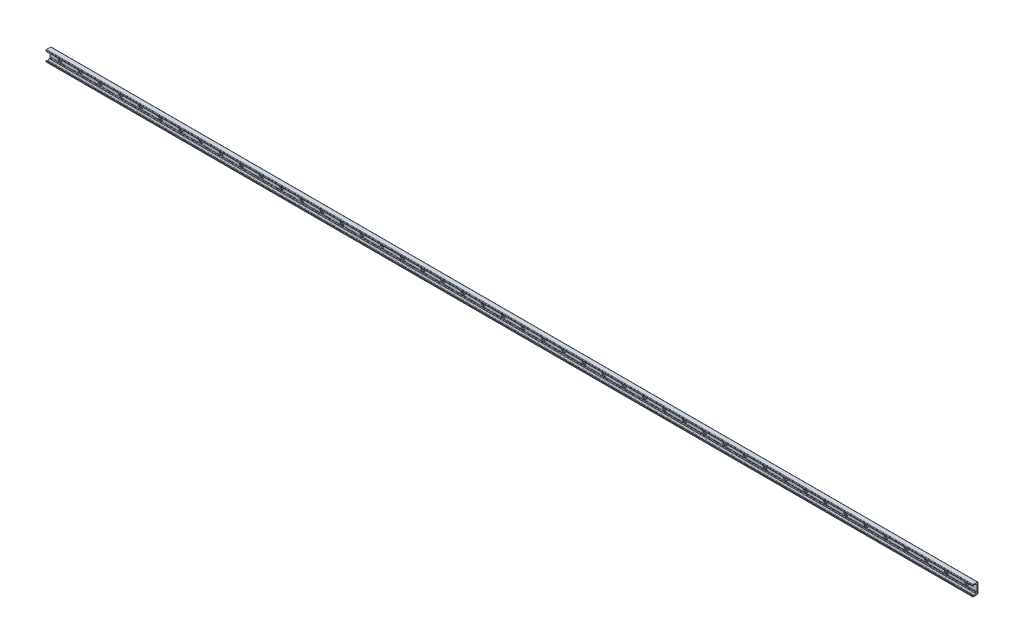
from build123d import *

# Parameters (mm, degrees)
BOSS_EXTRUDE1_DEPTH = 1840
SKETCH2_R           = 9
SKETCH2_R_2         = 4.5
CUT_EXTRUDE1_DEPTH  = 3.1
SKETCH2_2_R         = 4.5
CUT_EXTRUDE2_DEPTH  = 1841.199581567
LPATTERN1_COUNT     = 46
LPATTERN1_PITCH     = 80


with BuildPart() as part:
    # Sketch1 → Boss-Extrude1 (new, symmetric)
    with BuildSketch(Plane(origin=(0, 0, 0), x_dir=(0, 0, -1), z_dir=(1, 0, 0))):
        with BuildLine():
            Line((0, 0), (0, 19))
            ThreePointArc((0, 19), (-0.732233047, 20.767766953), (-2.5, 21.5))
            Line((-2.5, 21.5), (-19, 21.5))
            ThreePointArc((-19, 21.5), (-20.414213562, 20.914213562), (-21, 19.5))
            Line((-21, 19.5), (-21, 16.625057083))
            ThreePointArc((-21, 16.625057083), (-20.553251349, 15.888838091), (-19.693931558, 15.945160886))
            Line((-19.693931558, 15.945160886), (-16.794305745, 17.975500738))
            ThreePointArc((-16.794305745, 17.975500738), (-14.5, 18.69889256), (-12.205694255, 17.975500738))
            Line((-12.205694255, 17.975500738), (-8.829831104, 15.611695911))
            ThreePointArc((-8.829831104, 15.611695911), (-8.28408983, 15.342566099), (-7.682678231, 15.25))
            Line((-7.682678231, 15.25), (-6.5, 15.25))
            ThreePointArc((-6.5, 15.25), (-5.085786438, 14.664213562), (-4.5, 13.25))
            Line((-4.5, 13.25), (-4.5, -10.75))
            ThreePointArc((-4.5, -10.75), (-4.25, -11), (-4.5, -11.25))
            Line((-4.5, -11.25), (-4.5, -12.25))
            ThreePointArc((-4.5, -12.25), (-4.25, -12.5), (-4.5, -12.75))
            Line((-4.5, -12.75), (-4.5, -13.25))
            ThreePointArc((-4.5, -13.25), (-5.085786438, -14.664213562), (-6.5, -15.25))
            Line((-6.5, -15.25), (-7.682678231, -15.25))
            ThreePointArc((-7.682678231, -15.25), (-8.28408983, -15.342566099), (-8.829831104, -15.611695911))
            Line((-8.829831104, -15.611695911), (-12.205694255, -17.975500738))
            ThreePointArc((-12.205694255, -17.975500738), (-14.5, -18.69889256), (-16.794305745, -17.975500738))
            Line((-16.794305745, -17.975500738), (-19.693931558, -15.945160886))
            ThreePointArc((-19.693931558, -15.945160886), (-20.553251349, -15.888838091), (-21, -16.625057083))
            Line((-21, -16.625057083), (-21, -19.5))
            ThreePointArc((-21, -19.5), (-20.414213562, -20.914213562), (-19, -21.5))
            Line((-19, -21.5), (-2.5, -21.5))
            ThreePointArc((-2.5, -21.5), (-0.732233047, -20.767766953), (0, -19))
            Line((0, -19), (0, 0))
        make_face()
    extrude(amount=BOSS_EXTRUDE1_DEPTH, both=True)

    # Sketch2 → Cut-Extrude1 (cut)
    with BuildSketch(Plane.XY.offset(4.5)):
        with Locations((1800, 0)):
            Circle(SKETCH2_R)
        with Locations((1800, 0)):
            Circle(SKETCH2_R_2, mode=Mode.SUBTRACT)
    cut_extrude1 = extrude(amount=-CUT_EXTRUDE1_DEPTH, mode=Mode.SUBTRACT)

    # Sketch2_2 → Cut-Extrude2 (cut, through all)
    with BuildSketch(Plane.XY.offset(4.5)):
        with Locations((1800, 0)):
            Circle(SKETCH2_2_R)
    cut_extrude2 = extrude(amount=-CUT_EXTRUDE2_DEPTH, mode=Mode.SUBTRACT)

    # LPattern1: Cut-Extrude1, Cut-Extrude2 ×46
    with Locations(*[(-i * LPATTERN1_PITCH, 0, 0) for i in range(1, LPATTERN1_COUNT)]):
        add(cut_extrude1, mode=Mode.SUBTRACT)
        add(cut_extrude2, mode=Mode.SUBTRACT)


solid = part.part
